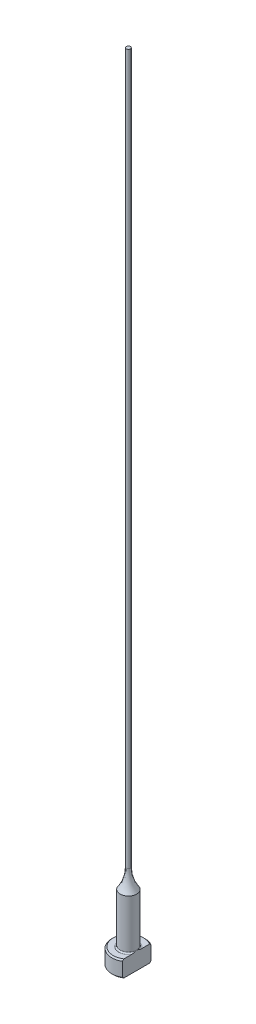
ISO-10303-21;
HEADER;
FILE_DESCRIPTION(('STEP AP214'),'2;1');
FILE_NAME('part.step','',(''),(''),'','','');
FILE_SCHEMA(('AUTOMOTIVE_DESIGN { 1 0 10303 214 1 1 1 1 }'));
ENDSEC;
DATA;
#1=APPLICATION_CONTEXT('core data for automotive mechanical design processes');
#2=APPLICATION_PROTOCOL_DEFINITION('international standard','automotive_design',2000,#1);
#3=PRODUCT_CONTEXT('',#1,'mechanical');
#4=PRODUCT('Part','Part','',(#3));
#5=PRODUCT_RELATED_PRODUCT_CATEGORY('part','',(#4));
#6=PRODUCT_DEFINITION_FORMATION('','',#4);
#7=PRODUCT_DEFINITION_CONTEXT('part definition',#1,'design');
#8=PRODUCT_DEFINITION('design','',#6,#7);
#9=PRODUCT_DEFINITION_SHAPE('','',#8);
#10=(LENGTH_UNIT() NAMED_UNIT(*) SI_UNIT(.MILLI.,.METRE.));
#11=(NAMED_UNIT(*) PLANE_ANGLE_UNIT() SI_UNIT($,.RADIAN.));
#12=(NAMED_UNIT(*) SI_UNIT($,.STERADIAN.) SOLID_ANGLE_UNIT());
#13=UNCERTAINTY_MEASURE_WITH_UNIT(LENGTH_MEASURE(1.E-05),#10,'distance_accuracy_value','');
#14=(GEOMETRIC_REPRESENTATION_CONTEXT(3) GLOBAL_UNCERTAINTY_ASSIGNED_CONTEXT((#13)) GLOBAL_UNIT_ASSIGNED_CONTEXT((#10,
#11,#12)) REPRESENTATION_CONTEXT('',''));
#15=CARTESIAN_POINT('',(0.,0.,0.));
#16=DIRECTION('',(0.,0.,1.));
#17=DIRECTION('',(1.,0.,0.));
#18=AXIS2_PLACEMENT_3D('',#15,#16,#17);
#19=CARTESIAN_POINT('',(-3.17499999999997,3.175,0.));
#20=DIRECTION('',(0.,1.,0.));
#21=DIRECTION('',(0.,0.,1.));
#22=AXIS2_PLACEMENT_3D('',#19,#20,#21);
#23=PLANE('',#22);
#24=CARTESIAN_POINT('',(0.,3.175,0.));
#25=DIRECTION('',(0.,1.,0.));
#26=DIRECTION('',(0.,0.,1.));
#27=AXIS2_PLACEMENT_3D('',#24,#25,#26);
#28=CIRCLE('',#27,2.92099999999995);
#29=CARTESIAN_POINT('',(1.58749999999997,3.175,-2.45195529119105));
#30=VERTEX_POINT('',#29);
#31=CARTESIAN_POINT('',(1.58749999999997,3.175,2.45195529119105));
#32=VERTEX_POINT('',#31);
#33=EDGE_CURVE('E105',#30,#32,#28,.T.);
#34=ORIENTED_EDGE('',*,*,#33,.T.);
#35=DIRECTION('',(0.,0.,1.));
#36=VECTOR('',#35,1.);
#37=CARTESIAN_POINT('',(1.58749999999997,3.17500000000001,2.74963065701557));
#38=LINE('',#37,#36);
#39=CARTESIAN_POINT('',(1.58749999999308,3.175,0.933255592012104));
#40=VERTEX_POINT('',#39);
#41=EDGE_CURVE('E126',#40,#32,#38,.T.);
#42=ORIENTED_EDGE('',*,*,#41,.F.);
#43=CARTESIAN_POINT('',(0.,3.175,0.));
#44=DIRECTION('',(0.,1.,0.));
#45=DIRECTION('',(0.,0.,1.));
#46=AXIS2_PLACEMENT_3D('',#43,#44,#45);
#47=CIRCLE('',#46,1.84149999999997);
#48=CARTESIAN_POINT('',(1.58749999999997,3.17500000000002,-0.933255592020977));
#49=VERTEX_POINT('',#48);
#50=EDGE_CURVE('E11',#40,#49,#47,.F.);
#51=ORIENTED_EDGE('',*,*,#50,.T.);
#52=EDGE_CURVE('E52',#30,#49,#38,.T.);
#53=ORIENTED_EDGE('',*,*,#52,.F.);
#54=EDGE_LOOP('',(#34,#42,#51,#53));
#55=FACE_BOUND('',#54,.T.);
#56=ADVANCED_FACE('F32',(#55),#23,.T.);
#57=CARTESIAN_POINT('',(0.,259.958771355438,0.));
#58=DIRECTION('',(0.,1.,0.));
#59=DIRECTION('',(0.,0.,1.));
#60=AXIS2_PLACEMENT_3D('',#57,#58,#59);
#61=CYLINDRICAL_SURFACE('',#60,3.17499999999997);
#62=CARTESIAN_POINT('',(0.,2.92100000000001,0.));
#63=DIRECTION('',(0.,1.,0.));
#64=DIRECTION('',(0.,0.,1.));
#65=AXIS2_PLACEMENT_3D('',#62,#63,#64);
#66=CIRCLE('',#65,3.17499999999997);
#67=CARTESIAN_POINT('',(1.58749999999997,2.92100000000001,2.74963065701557));
#68=VERTEX_POINT('',#67);
#69=CARTESIAN_POINT('',(1.58749999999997,2.92100000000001,-2.74963065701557));
#70=VERTEX_POINT('',#69);
#71=EDGE_CURVE('E98',#68,#70,#66,.F.);
#72=ORIENTED_EDGE('',*,*,#71,.T.);
#73=DIRECTION('',(0.,-1.,0.));
#74=VECTOR('',#73,1.);
#75=CARTESIAN_POINT('',(1.58749999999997,152.401,-2.74963065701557));
#76=LINE('',#75,#74);
#77=CARTESIAN_POINT('',(1.58749999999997,0.254000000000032,-2.74963065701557));
#78=VERTEX_POINT('',#77);
#79=EDGE_CURVE('E141',#70,#78,#76,.T.);
#80=ORIENTED_EDGE('',*,*,#79,.T.);
#81=CARTESIAN_POINT('',(0.,0.254000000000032,0.));
#82=DIRECTION('',(0.,-1.,0.));
#83=DIRECTION('',(0.,0.,-1.));
#84=AXIS2_PLACEMENT_3D('',#81,#82,#83);
#85=CIRCLE('',#84,3.17499999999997);
#86=CARTESIAN_POINT('',(1.58749999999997,0.254000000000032,2.74963065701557));
#87=VERTEX_POINT('',#86);
#88=EDGE_CURVE('E95',#78,#87,#85,.F.);
#89=ORIENTED_EDGE('',*,*,#88,.T.);
#90=DIRECTION('',(0.,-1.,0.));
#91=VECTOR('',#90,1.);
#92=CARTESIAN_POINT('',(1.58749999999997,152.401,2.74963065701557));
#93=LINE('',#92,#91);
#94=EDGE_CURVE('E88',#68,#87,#93,.T.);
#95=ORIENTED_EDGE('',*,*,#94,.F.);
#96=EDGE_LOOP('',(#72,#80,#89,#95));
#97=FACE_BOUND('',#96,.T.);
#98=ADVANCED_FACE('F191',(#97),#61,.T.);
#99=CARTESIAN_POINT('',(0.,0.,0.));
#100=DIRECTION('',(0.,-1.,0.));
#101=DIRECTION('',(0.,0.,-1.));
#102=AXIS2_PLACEMENT_3D('',#99,#100,#101);
#103=PLANE('',#102);
#104=CARTESIAN_POINT('',(0.,0.,0.));
#105=DIRECTION('',(0.,-1.,0.));
#106=DIRECTION('',(0.,0.,-1.));
#107=AXIS2_PLACEMENT_3D('',#104,#105,#106);
#108=CIRCLE('',#107,2.92099999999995);
#109=CARTESIAN_POINT('',(1.58749999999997,0.,2.45195529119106));
#110=VERTEX_POINT('',#109);
#111=CARTESIAN_POINT('',(1.58749999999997,0.,-2.45195529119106));
#112=VERTEX_POINT('',#111);
#113=EDGE_CURVE('E93',#110,#112,#108,.T.);
#114=ORIENTED_EDGE('',*,*,#113,.T.);
#115=DIRECTION('',(0.,0.,1.));
#116=VECTOR('',#115,1.);
#117=CARTESIAN_POINT('',(1.58749999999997,0.,2.74963065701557));
#118=LINE('',#117,#116);
#119=EDGE_CURVE('E78',#112,#110,#118,.T.);
#120=ORIENTED_EDGE('',*,*,#119,.T.);
#121=EDGE_LOOP('',(#114,#120));
#122=FACE_BOUND('',#121,.T.);
#123=ADVANCED_FACE('F97',(#122),#103,.T.);
#124=CARTESIAN_POINT('',(0.,3.17499999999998,0.));
#125=DIRECTION('',(0.,-1.,0.));
#126=DIRECTION('',(0.,0.,-1.));
#127=AXIS2_PLACEMENT_3D('',#124,#125,#126);
#128=CONICAL_SURFACE('',#127,2.92099999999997,0.7853981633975);
#129=ORIENTED_EDGE('',*,*,#71,.F.);
#130=CARTESIAN_POINT('',(1.58749999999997,-0.161620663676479,-6.0529050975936));
#131=CARTESIAN_POINT('',(1.58749999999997,-0.0288893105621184,-5.91567682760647));
#132=CARTESIAN_POINT('',(1.58749999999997,0.103699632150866,-5.77831035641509));
#133=CARTESIAN_POINT('',(1.58749999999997,0.36850839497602,-5.5032187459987));
#134=CARTESIAN_POINT('',(1.58749999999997,0.500728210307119,-5.36549360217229));
#135=CARTESIAN_POINT('',(1.58749999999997,0.764778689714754,-5.08953516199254));
#136=CARTESIAN_POINT('',(1.58749999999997,0.896609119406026,-4.95130164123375));
#137=CARTESIAN_POINT('',(1.58749999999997,1.15968706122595,-4.67428233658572));
#138=CARTESIAN_POINT('',(1.58749999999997,1.29093457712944,-4.53549655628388));
#139=CARTESIAN_POINT('',(1.58749999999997,1.55007705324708,-4.25997724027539));
#140=CARTESIAN_POINT('',(1.58749999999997,1.67798684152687,-4.12325766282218));
#141=CARTESIAN_POINT('',(1.58749999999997,1.93284861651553,-3.84892898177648));
#142=CARTESIAN_POINT('',(1.58749999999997,2.05980060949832,-3.71131988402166));
#143=CARTESIAN_POINT('',(1.58749999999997,2.31237508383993,-3.43493978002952));
#144=CARTESIAN_POINT('',(1.58749999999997,2.43799784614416,-3.29616903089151));
#145=CARTESIAN_POINT('',(1.58749999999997,2.68741369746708,-3.01699558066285));
#146=CARTESIAN_POINT('',(1.58749999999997,2.81120686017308,-2.87659294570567));
#147=CARTESIAN_POINT('',(1.58749999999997,3.0087586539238,-2.6481670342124));
#148=CARTESIAN_POINT('',(1.58749999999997,3.08336151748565,-2.56087478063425));
#149=CARTESIAN_POINT('',(1.58749999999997,3.23123871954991,-2.38515423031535));
#150=CARTESIAN_POINT('',(1.58749999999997,3.30451292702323,-2.29672582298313));
#151=CARTESIAN_POINT('',(1.58749999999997,3.45004422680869,-2.1174740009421));
#152=CARTESIAN_POINT('',(1.58749999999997,3.52228237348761,-2.02663514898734));
#153=CARTESIAN_POINT('',(1.58749999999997,3.6642309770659,-1.8430252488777));
#154=CARTESIAN_POINT('',(1.58749999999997,3.73394203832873,-1.75025467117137));
#155=CARTESIAN_POINT('',(1.58749999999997,3.87080633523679,-1.56067475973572));
#156=CARTESIAN_POINT('',(1.58749999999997,3.93790459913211,-1.46382547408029));
#157=CARTESIAN_POINT('',(1.58749999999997,4.06669147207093,-1.26632594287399));
#158=CARTESIAN_POINT('',(1.58749999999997,4.12837264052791,-1.16567073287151));
#159=CARTESIAN_POINT('',(1.58749999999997,4.2140225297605,-1.01165766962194));
#160=CARTESIAN_POINT('',(1.58749999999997,4.24127929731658,-0.960142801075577));
#161=CARTESIAN_POINT('',(1.58749999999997,4.29309798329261,-0.855780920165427));
#162=CARTESIAN_POINT('',(1.58749999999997,4.31765941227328,-0.802933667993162));
#163=CARTESIAN_POINT('',(1.58749999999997,4.38614656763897,-0.64246114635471));
#164=CARTESIAN_POINT('',(1.58749999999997,4.42510149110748,-0.532518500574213));
#165=CARTESIAN_POINT('',(1.58749999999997,4.46726244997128,-0.367680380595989));
#166=CARTESIAN_POINT('',(1.58749999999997,4.47844427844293,-0.314802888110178));
#167=CARTESIAN_POINT('',(1.58749999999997,4.495766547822,-0.2082097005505));
#168=CARTESIAN_POINT('',(1.58749999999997,4.50190743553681,-0.154494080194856));
#169=CARTESIAN_POINT('',(1.58749999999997,4.50871296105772,-0.0468792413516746));
#170=CARTESIAN_POINT('',(1.58749999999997,4.50939451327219,0.0070188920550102));
#171=CARTESIAN_POINT('',(1.58749999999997,4.50527679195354,0.114606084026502));
#172=CARTESIAN_POINT('',(1.58749999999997,4.50047706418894,0.168295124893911));
#173=CARTESIAN_POINT('',(1.58749999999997,4.48579689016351,0.274485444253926));
#174=CARTESIAN_POINT('',(1.58749999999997,4.47596081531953,0.326992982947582));
#175=CARTESIAN_POINT('',(1.58749999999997,4.45181809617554,0.430974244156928));
#176=CARTESIAN_POINT('',(1.58749999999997,4.43750969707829,0.48244755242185));
#177=CARTESIAN_POINT('',(1.58749999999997,4.40502489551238,0.584460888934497));
#178=CARTESIAN_POINT('',(1.58749999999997,4.38682724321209,0.634994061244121));
#179=CARTESIAN_POINT('',(1.58749999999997,4.34729308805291,0.734789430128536));
#180=CARTESIAN_POINT('',(1.58749999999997,4.32595722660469,0.784051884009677));
#181=CARTESIAN_POINT('',(1.58749999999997,4.25791922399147,0.930549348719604));
#182=CARTESIAN_POINT('',(1.58749999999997,4.20736047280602,1.02598802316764));
#183=CARTESIAN_POINT('',(1.58749999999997,4.09955451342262,1.2130431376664));
#184=CARTESIAN_POINT('',(1.58749999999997,4.04229912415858,1.30465471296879));
#185=CARTESIAN_POINT('',(1.58749999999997,3.9230874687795,1.4852621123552));
#186=CARTESIAN_POINT('',(1.58749999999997,3.86111349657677,1.57424615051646));
#187=CARTESIAN_POINT('',(1.58749999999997,3.73408621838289,1.74990003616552));
#188=CARTESIAN_POINT('',(1.58749999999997,3.66903444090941,1.8365709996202));
#189=CARTESIAN_POINT('',(1.58749999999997,3.53583371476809,2.00931764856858));
#190=CARTESIAN_POINT('',(1.58749999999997,3.46765527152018,2.09537048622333));
#191=CARTESIAN_POINT('',(1.58749999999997,3.32960643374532,2.26611736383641));
#192=CARTESIAN_POINT('',(1.58749999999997,3.25973586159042,2.35081125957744));
#193=CARTESIAN_POINT('',(1.58749999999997,3.04858139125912,2.60290121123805));
#194=CARTESIAN_POINT('',(1.58749999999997,2.90542388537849,2.76872537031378));
#195=CARTESIAN_POINT('',(1.58749999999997,2.64069522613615,3.06970913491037));
#196=CARTESIAN_POINT('',(1.58749999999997,2.5195945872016,3.20528660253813));
#197=CARTESIAN_POINT('',(1.58749999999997,2.275904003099,3.47510321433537));
#198=CARTESIAN_POINT('',(1.58749999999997,2.15331401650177,3.60934232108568));
#199=CARTESIAN_POINT('',(1.58749999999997,1.90694239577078,3.87695374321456));
#200=CARTESIAN_POINT('',(1.58749999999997,1.78315974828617,4.01032512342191));
#201=CARTESIAN_POINT('',(1.58749999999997,1.53478104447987,4.2763088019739));
#202=CARTESIAN_POINT('',(1.58749999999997,1.41018498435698,4.40892109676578));
#203=CARTESIAN_POINT('',(1.58749999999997,1.0457468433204,4.79499418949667));
#204=CARTESIAN_POINT('',(1.58749999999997,0.805076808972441,5.04767313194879));
#205=CARTESIAN_POINT('',(1.58749999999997,0.443121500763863,5.42550911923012));
#206=CARTESIAN_POINT('',(1.58749999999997,0.322378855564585,5.55118772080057));
#207=CARTESIAN_POINT('',(1.58749999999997,0.0805914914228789,5.80225207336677));
#208=CARTESIAN_POINT('',(1.58749999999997,-0.0404532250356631,5.92763782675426));
#209=CARTESIAN_POINT('',(1.58749999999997,-0.161620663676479,6.0529050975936));
#210=B_SPLINE_CURVE_WITH_KNOTS('',3,(#130,#131,#132,#133,#134,#135,#136,#137,#138,#139,#140,
#141,#142,#143,#144,#145,#146,#147,#148,#149,#150,#151,#152,#153,#154,#155,#156,#157,#158,#159,
#160,#161,#162,#163,#164,#165,#166,#167,#168,#169,#170,#171,#172,#173,#174,#175,#176,#177,#178,
#179,#180,#181,#182,#183,#184,#185,#186,#187,#188,#189,#190,#191,#192,#193,#194,#195,#196,#197,
#198,#199,#200,#201,#202,#203,#204,#205,#206,#207,#208,#209),.UNSPECIFIED.,.F.,.F.,(4,2,2,2,2,2,
2,2,2,2,2,2,2,2,2,2,2,2,2,2,2,2,2,2,2,2,2,2,2,2,2,2,2,2,2,2,2,2,2,4),(0.,0.572750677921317,
1.14550874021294,1.71856057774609,2.29160869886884,2.85328006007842,3.41494773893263,
3.97649423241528,4.53801804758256,4.88249307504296,5.22700189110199,5.57515326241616,
5.92322081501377,6.27657800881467,6.63041319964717,6.80518126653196,6.97998101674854,
7.32824262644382,7.49018491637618,7.65211285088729,7.813538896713,7.97497832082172,
8.13501929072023,8.29512313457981,8.4561251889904,8.61709438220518,8.94062993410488,
9.26456495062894,9.58978187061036,9.91483894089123,10.2441741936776,10.5735441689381,
11.2306812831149,11.7760337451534,12.3214014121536,12.8672825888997,13.4131663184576,
14.4600164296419,14.9828595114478,15.505698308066),.UNSPECIFIED.);
#211=EDGE_CURVE('E118',#32,#68,#210,.T.);
#212=ORIENTED_EDGE('',*,*,#211,.F.);
#213=ORIENTED_EDGE('',*,*,#33,.F.);
#214=EDGE_CURVE('E117',#70,#30,#210,.T.);
#215=ORIENTED_EDGE('',*,*,#214,.F.);
#216=EDGE_LOOP('',(#129,#212,#213,#215));
#217=FACE_BOUND('',#216,.T.);
#218=ADVANCED_FACE('F162',(#217),#128,.T.);
#219=CARTESIAN_POINT('',(0.,0.254000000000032,0.));
#220=DIRECTION('',(0.,1.,0.));
#221=DIRECTION('',(0.,0.,1.));
#222=AXIS2_PLACEMENT_3D('',#219,#220,#221);
#223=CONICAL_SURFACE('',#222,3.17499999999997,0.785398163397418);
#224=ORIENTED_EDGE('',*,*,#88,.F.);
#225=CARTESIAN_POINT('',(1.58749999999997,3.33662066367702,6.0529050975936));
#226=CARTESIAN_POINT('',(1.58749999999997,3.20388931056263,5.91567682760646));
#227=CARTESIAN_POINT('',(1.58749999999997,3.0713003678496,5.77831035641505));
#228=CARTESIAN_POINT('',(1.58749999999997,2.80649160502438,5.50321874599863));
#229=CARTESIAN_POINT('',(1.58749999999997,2.67427178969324,5.36549360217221));
#230=CARTESIAN_POINT('',(1.58749999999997,2.41022131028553,5.08953516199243));
#231=CARTESIAN_POINT('',(1.58749999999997,2.27839088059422,4.95130164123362));
#232=CARTESIAN_POINT('',(1.58749999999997,2.01531293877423,4.67428233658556));
#233=CARTESIAN_POINT('',(1.58749999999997,1.8840654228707,4.5354965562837));
#234=CARTESIAN_POINT('',(1.58749999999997,1.62492294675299,4.25997724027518));
#235=CARTESIAN_POINT('',(1.58749999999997,1.49701315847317,4.12325766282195));
#236=CARTESIAN_POINT('',(1.58749999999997,1.24215138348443,3.84892898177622));
#237=CARTESIAN_POINT('',(1.58749999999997,1.11519939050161,3.71131988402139));
#238=CARTESIAN_POINT('',(1.58749999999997,0.862624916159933,3.43493978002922));
#239=CARTESIAN_POINT('',(1.58749999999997,0.737002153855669,3.29616903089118));
#240=CARTESIAN_POINT('',(1.58749999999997,0.487586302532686,3.01699558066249));
#241=CARTESIAN_POINT('',(1.58749999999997,0.363793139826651,2.8765929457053));
#242=CARTESIAN_POINT('',(1.58749999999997,0.1662413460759,2.64816703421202));
#243=CARTESIAN_POINT('',(1.58749999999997,0.0916384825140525,2.56087478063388));
#244=CARTESIAN_POINT('',(1.58749999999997,-0.0562387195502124,2.385154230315));
#245=CARTESIAN_POINT('',(1.58749999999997,-0.129512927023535,2.29672582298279));
#246=CARTESIAN_POINT('',(1.58749999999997,-0.275044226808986,2.11747400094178));
#247=CARTESIAN_POINT('',(1.58749999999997,-0.34728237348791,2.02663514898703));
#248=CARTESIAN_POINT('',(1.58749999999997,-0.489230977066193,1.84302524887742));
#249=CARTESIAN_POINT('',(1.58749999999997,-0.558942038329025,1.75025467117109));
#250=CARTESIAN_POINT('',(1.58749999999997,-0.695806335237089,1.56067475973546));
#251=CARTESIAN_POINT('',(1.58749999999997,-0.762904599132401,1.46382547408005));
#252=CARTESIAN_POINT('',(1.58749999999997,-0.89169147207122,1.26632594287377));
#253=CARTESIAN_POINT('',(1.58749999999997,-0.953372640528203,1.16567073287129));
#254=CARTESIAN_POINT('',(1.58749999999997,-1.03902252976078,1.01165766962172));
#255=CARTESIAN_POINT('',(1.58749999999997,-1.06627929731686,0.960142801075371));
#256=CARTESIAN_POINT('',(1.58749999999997,-1.11809798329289,0.855780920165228));
#257=CARTESIAN_POINT('',(1.58749999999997,-1.14265941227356,0.802933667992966));
#258=CARTESIAN_POINT('',(1.58749999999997,-1.21114656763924,0.642461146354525));
#259=CARTESIAN_POINT('',(1.58749999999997,-1.25010149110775,0.532518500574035));
#260=CARTESIAN_POINT('',(1.58749999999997,-1.29226244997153,0.36768038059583));
#261=CARTESIAN_POINT('',(1.58749999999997,-1.30344427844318,0.31480288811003));
#262=CARTESIAN_POINT('',(1.58749999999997,-1.32076654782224,0.208209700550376));
#263=CARTESIAN_POINT('',(1.58749999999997,-1.32690743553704,0.154494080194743));
#264=CARTESIAN_POINT('',(1.58749999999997,-1.33371296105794,0.0468792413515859));
#265=CARTESIAN_POINT('',(1.58749999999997,-1.33439451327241,-0.0070188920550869));
#266=CARTESIAN_POINT('',(1.58749999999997,-1.33027679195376,-0.114606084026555));
#267=CARTESIAN_POINT('',(1.58749999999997,-1.32547706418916,-0.168295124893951));
#268=CARTESIAN_POINT('',(1.58749999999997,-1.31079689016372,-0.274485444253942));
#269=CARTESIAN_POINT('',(1.58749999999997,-1.30096081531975,-0.326992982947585));
#270=CARTESIAN_POINT('',(1.58749999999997,-1.27681809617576,-0.430974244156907));
#271=CARTESIAN_POINT('',(1.58749999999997,-1.26250969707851,-0.482447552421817));
#272=CARTESIAN_POINT('',(1.58749999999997,-1.2300248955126,-0.584460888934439));
#273=CARTESIAN_POINT('',(1.58749999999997,-1.21182724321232,-0.634994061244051));
#274=CARTESIAN_POINT('',(1.58749999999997,-1.17229308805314,-0.734789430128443));
#275=CARTESIAN_POINT('',(1.58749999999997,-1.15095722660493,-0.784051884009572));
#276=CARTESIAN_POINT('',(1.58749999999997,-1.08291922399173,-0.93054934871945));
#277=CARTESIAN_POINT('',(1.58749999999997,-1.0323604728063,-1.02598802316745));
#278=CARTESIAN_POINT('',(1.58749999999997,-0.92455451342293,-1.21304313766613));
#279=CARTESIAN_POINT('',(1.58749999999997,-0.867299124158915,-1.30465471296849));
#280=CARTESIAN_POINT('',(1.58749999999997,-0.748087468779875,-1.48526211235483));
#281=CARTESIAN_POINT('',(1.58749999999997,-0.686113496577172,-1.57424615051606));
#282=CARTESIAN_POINT('',(1.58749999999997,-0.559086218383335,-1.74990003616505));
#283=CARTESIAN_POINT('',(1.58749999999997,-0.494034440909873,-1.83657099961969));
#284=CARTESIAN_POINT('',(1.58749999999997,-0.360833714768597,-2.00931764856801));
#285=CARTESIAN_POINT('',(1.58749999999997,-0.292655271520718,-2.09537048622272));
#286=CARTESIAN_POINT('',(1.58749999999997,-0.154606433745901,-2.26611736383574));
#287=CARTESIAN_POINT('',(1.58749999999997,-0.084735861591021,-2.35081125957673));
#288=CARTESIAN_POINT('',(1.58749999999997,0.126418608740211,-2.60290121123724));
#289=CARTESIAN_POINT('',(1.58749999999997,0.26957611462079,-2.76872537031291));
#290=CARTESIAN_POINT('',(1.58749999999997,0.534304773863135,-3.06970913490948));
#291=CARTESIAN_POINT('',(1.58749999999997,0.655405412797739,-3.20528660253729));
#292=CARTESIAN_POINT('',(1.58749999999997,0.899095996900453,-3.47510321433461));
#293=CARTESIAN_POINT('',(1.58749999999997,1.02168598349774,-3.60934232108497));
#294=CARTESIAN_POINT('',(1.58749999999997,1.26805760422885,-3.87695374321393));
#295=CARTESIAN_POINT('',(1.58749999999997,1.39184025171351,-4.01032512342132));
#296=CARTESIAN_POINT('',(1.58749999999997,1.64021895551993,-4.2763088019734));
#297=CARTESIAN_POINT('',(1.58749999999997,1.76481501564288,-4.40892109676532));
#298=CARTESIAN_POINT('',(1.58749999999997,2.12925315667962,-4.79499418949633));
#299=CARTESIAN_POINT('',(1.58749999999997,2.36992319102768,-5.04767313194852));
#300=CARTESIAN_POINT('',(1.58749999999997,2.73187849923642,-5.42550911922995));
#301=CARTESIAN_POINT('',(1.58749999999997,2.85262114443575,-5.55118772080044));
#302=CARTESIAN_POINT('',(1.58749999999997,3.09440850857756,-5.8022520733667));
#303=CARTESIAN_POINT('',(1.58749999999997,3.21545322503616,-5.92763782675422));
#304=CARTESIAN_POINT('',(1.58749999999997,3.33662066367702,-6.0529050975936));
#305=B_SPLINE_CURVE_WITH_KNOTS('',3,(#225,#226,#227,#228,#229,#230,#231,#232,#233,#234,#235,
#236,#237,#238,#239,#240,#241,#242,#243,#244,#245,#246,#247,#248,#249,#250,#251,#252,#253,#254,
#255,#256,#257,#258,#259,#260,#261,#262,#263,#264,#265,#266,#267,#268,#269,#270,#271,#272,#273,
#274,#275,#276,#277,#278,#279,#280,#281,#282,#283,#284,#285,#286,#287,#288,#289,#290,#291,#292,
#293,#294,#295,#296,#297,#298,#299,#300,#301,#302,#303,#304),.UNSPECIFIED.,.F.,.F.,(4,2,2,2,2,2,
2,2,2,2,2,2,2,2,2,2,2,2,2,2,2,2,2,2,2,2,2,2,2,2,2,2,2,2,2,2,2,2,2,4),(0.,0.572750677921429,
1.14550874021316,1.71856057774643,2.29160869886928,2.85328006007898,3.41494773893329,
3.97649423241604,4.53801804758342,4.8824930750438,5.22700189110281,5.57515326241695,
5.92322081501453,6.27657800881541,6.63041319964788,6.80518126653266,6.97998101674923,
7.32824262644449,7.49018491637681,7.65211285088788,7.81353889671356,7.97497832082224,
8.13501929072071,8.29512313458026,8.45612518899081,8.61709438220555,8.94062993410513,
9.26456495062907,9.58978187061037,9.91483894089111,10.2441741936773,10.5735441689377,
11.2306812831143,11.776033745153,12.3214014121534,12.8672825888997,13.4131663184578,
14.4600164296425,14.9828595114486,15.505698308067),.UNSPECIFIED.);
#306=EDGE_CURVE('E81',#112,#78,#305,.T.);
#307=ORIENTED_EDGE('',*,*,#306,.F.);
#308=ORIENTED_EDGE('',*,*,#113,.F.);
#309=EDGE_CURVE('E84',#87,#110,#305,.T.);
#310=ORIENTED_EDGE('',*,*,#309,.F.);
#311=EDGE_LOOP('',(#224,#307,#308,#310));
#312=FACE_BOUND('',#311,.T.);
#313=ADVANCED_FACE('F92',(#312),#223,.T.);
#314=CARTESIAN_POINT('',(0.,3.42900000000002,0.));
#315=DIRECTION('',(0.,1.,0.));
#316=DIRECTION('',(0.,0.,1.));
#317=AXIS2_PLACEMENT_3D('',#314,#315,#316);
#318=TOROIDAL_SURFACE('',#317,1.84149999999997,0.254);
#319=CARTESIAN_POINT('',(1.58749999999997,3.42900000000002,0.));
#320=CARTESIAN_POINT('',(1.58749999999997,3.42899942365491,-1.9220514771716E-10));
#321=CARTESIAN_POINT('',(1.58749999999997,3.42899884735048,-1.2261161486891E-07));
#322=CARTESIAN_POINT('',(1.58749999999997,3.42899773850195,-5.09676365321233E-07));
#323=CARTESIAN_POINT('',(1.58749999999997,3.42899720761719,-7.78176328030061E-07));
#324=CARTESIAN_POINT('',(1.58749999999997,3.42899614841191,-1.42307272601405E-06));
#325=CARTESIAN_POINT('',(1.58749999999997,3.42899562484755,-1.80713867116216E-06));
#326=CARTESIAN_POINT('',(1.58749999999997,3.42899463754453,-2.63494846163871E-06));
#327=CARTESIAN_POINT('',(1.58749999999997,3.42899417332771,-3.07814756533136E-06));
#328=CARTESIAN_POINT('',(1.58749999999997,3.42899261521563,-4.66897357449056E-06));
#329=CARTESIAN_POINT('',(1.58749999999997,3.42899159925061,-5.89404908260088E-06));
#330=CARTESIAN_POINT('',(1.58749999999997,3.42898979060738,-8.42427511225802E-06));
#331=CARTESIAN_POINT('',(1.58749999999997,3.42898899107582,-9.7248057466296E-06));
#332=CARTESIAN_POINT('',(1.58749999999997,3.42898598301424,-1.48060601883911E-05));
#333=CARTESIAN_POINT('',(1.58749999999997,3.42898393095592,-1.86838281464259E-05));
#334=CARTESIAN_POINT('',(1.58749999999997,3.42898057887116,-2.63261117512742E-05));
#335=CARTESIAN_POINT('',(1.58749999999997,3.42897922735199,-3.00687417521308E-05));
#336=CARTESIAN_POINT('',(1.58749999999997,3.42897347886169,-4.60276298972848E-05));
#337=CARTESIAN_POINT('',(1.58749999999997,3.42896911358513,-5.8247019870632E-05));
#338=CARTESIAN_POINT('',(1.58749999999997,3.42896211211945,-8.11070097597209E-05));
#339=CARTESIAN_POINT('',(1.58749999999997,3.42895931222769,-9.16953114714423E-05));
#340=CARTESIAN_POINT('',(1.58749999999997,3.42893712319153,-0.000168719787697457));
#341=CARTESIAN_POINT('',(1.58749999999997,3.42890881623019,-0.000232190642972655));
#342=CARTESIAN_POINT('',(1.58749999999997,3.42880276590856,-0.000479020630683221));
#343=CARTESIAN_POINT('',(1.58749999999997,3.42873165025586,-0.00066443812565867));
#344=CARTESIAN_POINT('',(1.58749999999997,3.42845137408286,-0.0013844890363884));
#345=CARTESIAN_POINT('',(1.58749999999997,3.42823526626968,-0.00191701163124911));
#346=CARTESIAN_POINT('',(1.58749999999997,3.42735449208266,-0.00409774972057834));
#347=CARTESIAN_POINT('',(1.58749999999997,3.42669768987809,-0.00574830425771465));
#348=CARTESIAN_POINT('',(1.58749999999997,3.4174405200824,-0.0289985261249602));
#349=CARTESIAN_POINT('',(1.58749999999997,3.40878325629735,-0.0505816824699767));
#350=CARTESIAN_POINT('',(1.58749999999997,3.39189297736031,-0.0929947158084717));
#351=CARTESIAN_POINT('',(1.58749999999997,3.38365605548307,-0.11382315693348));
#352=CARTESIAN_POINT('',(1.58749999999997,3.36635393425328,-0.157956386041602));
#353=CARTESIAN_POINT('',(1.58749999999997,3.35730391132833,-0.181267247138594));
#354=CARTESIAN_POINT('',(1.58749999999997,3.33936775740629,-0.228222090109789));
#355=CARTESIAN_POINT('',(1.58749999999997,3.33048420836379,-0.25186705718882));
#356=CARTESIAN_POINT('',(1.58749999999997,3.30894496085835,-0.310512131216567));
#357=CARTESIAN_POINT('',(1.58749999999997,3.29649449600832,-0.345588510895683));
#358=CARTESIAN_POINT('',(1.58749999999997,3.27296975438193,-0.415278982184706));
#359=CARTESIAN_POINT('',(1.58749999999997,3.26186987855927,-0.449884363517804));
#360=CARTESIAN_POINT('',(1.58749999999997,3.2395832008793,-0.524471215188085));
#361=CARTESIAN_POINT('',(1.58749999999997,3.22860862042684,-0.564517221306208));
#362=CARTESIAN_POINT('',(1.58749999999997,3.20902534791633,-0.645529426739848));
#363=CARTESIAN_POINT('',(1.58749999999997,3.20043582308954,-0.686500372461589));
#364=CARTESIAN_POINT('',(1.58749999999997,3.18611712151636,-0.771546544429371));
#365=CARTESIAN_POINT('',(1.58749999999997,3.18059550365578,-0.815658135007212));
#366=CARTESIAN_POINT('',(1.58749999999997,3.17455396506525,-0.904117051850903));
#367=CARTESIAN_POINT('',(1.58749999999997,3.17401361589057,-0.948462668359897));
#368=CARTESIAN_POINT('',(1.58749999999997,3.17898948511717,-1.02531896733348));
#369=CARTESIAN_POINT('',(1.58749999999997,3.1829739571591,-1.05792141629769));
#370=CARTESIAN_POINT('',(1.58749999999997,3.19569167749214,-1.12184393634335));
#371=CARTESIAN_POINT('',(1.58749999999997,3.20436049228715,-1.1531753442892));
#372=CARTESIAN_POINT('',(1.58749999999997,3.22236152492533,-1.19946468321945));
#373=CARTESIAN_POINT('',(1.58749999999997,3.2295150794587,-1.21526783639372));
#374=CARTESIAN_POINT('',(1.58749999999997,3.24587062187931,-1.24583726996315));
#375=CARTESIAN_POINT('',(1.58749999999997,3.25507530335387,-1.26060215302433));
#376=CARTESIAN_POINT('',(1.58749999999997,3.27378481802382,-1.28575815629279));
#377=CARTESIAN_POINT('',(1.58749999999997,3.28289001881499,-1.29644383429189));
#378=CARTESIAN_POINT('',(1.58749999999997,3.30268460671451,-1.31623154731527));
#379=CARTESIAN_POINT('',(1.58749999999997,3.31337067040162,-1.32533681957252));
#380=CARTESIAN_POINT('',(1.58749999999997,3.33349977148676,-1.33941140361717));
#381=CARTESIAN_POINT('',(1.58749999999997,3.34261446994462,-1.34484814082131));
#382=CARTESIAN_POINT('',(1.58749999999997,3.36161455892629,-1.35416329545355));
#383=CARTESIAN_POINT('',(1.58749999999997,3.37149946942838,-1.35804267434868));
#384=CARTESIAN_POINT('',(1.58749999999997,3.39188678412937,-1.36398436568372));
#385=CARTESIAN_POINT('',(1.58749999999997,3.40239309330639,-1.36603350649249));
#386=CARTESIAN_POINT('',(1.58749999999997,3.42360372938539,-1.3680840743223));
#387=CARTESIAN_POINT('',(1.58749999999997,3.43430795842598,-1.36808648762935));
#388=CARTESIAN_POINT('',(1.58749999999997,3.45433283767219,-1.36616208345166));
#389=CARTESIAN_POINT('',(1.58749999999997,3.46367506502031,-1.36444960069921));
#390=CARTESIAN_POINT('',(1.58749999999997,3.48195519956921,-1.35953338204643));
#391=CARTESIAN_POINT('',(1.58749999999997,3.49089304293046,-1.3563294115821));
#392=CARTESIAN_POINT('',(1.58749999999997,3.50850302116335,-1.34848006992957));
#393=CARTESIAN_POINT('',(1.58749999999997,3.5171531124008,-1.34378578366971));
#394=CARTESIAN_POINT('',(1.58749999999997,3.53371257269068,-1.33324445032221));
#395=CARTESIAN_POINT('',(1.58749999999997,3.54162163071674,-1.32739692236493));
#396=CARTESIAN_POINT('',(1.58749999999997,3.56107121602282,-1.31107304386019));
#397=CARTESIAN_POINT('',(1.58749999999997,3.57202221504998,-1.29989286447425));
#398=CARTESIAN_POINT('',(1.58749999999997,3.59202509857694,-1.27593566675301));
#399=CARTESIAN_POINT('',(1.58749999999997,3.60107086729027,-1.26315370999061));
#400=CARTESIAN_POINT('',(1.58749999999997,3.62186023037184,-1.22930733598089));
#401=CARTESIAN_POINT('',(1.58749999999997,3.63240584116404,-1.20751096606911));
#402=CARTESIAN_POINT('',(1.58749999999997,3.65004643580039,-1.16266144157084));
#403=CARTESIAN_POINT('',(1.58749999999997,3.65714435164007,-1.13960937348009));
#404=CARTESIAN_POINT('',(1.58749999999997,3.67265428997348,-1.07603916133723));
#405=CARTESIAN_POINT('',(1.58749999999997,3.67834921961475,-1.03486686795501));
#406=CARTESIAN_POINT('',(1.58749999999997,3.68382880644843,-0.951558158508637));
#407=CARTESIAN_POINT('',(1.58749999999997,3.68350976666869,-0.909417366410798));
#408=CARTESIAN_POINT('',(1.58749999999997,3.67745397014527,-0.811383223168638));
#409=CARTESIAN_POINT('',(1.58749999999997,3.66993873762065,-0.755610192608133));
#410=CARTESIAN_POINT('',(1.58749999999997,3.64933373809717,-0.644937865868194));
#411=CARTESIAN_POINT('',(1.58749999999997,3.63621897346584,-0.59004364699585));
#412=CARTESIAN_POINT('',(1.58749999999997,3.60740922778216,-0.485757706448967));
#413=CARTESIAN_POINT('',(1.58749999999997,3.59201096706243,-0.436281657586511));
#414=CARTESIAN_POINT('',(1.58749999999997,3.55922497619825,-0.338551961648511));
#415=CARTESIAN_POINT('',(1.58749999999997,3.5418584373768,-0.290291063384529));
#416=CARTESIAN_POINT('',(1.58749999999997,3.51760237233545,-0.225557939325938));
#417=CARTESIAN_POINT('',(1.58749999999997,3.51126413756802,-0.208874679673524));
#418=CARTESIAN_POINT('',(1.58749999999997,3.49830042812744,-0.17512392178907));
#419=CARTESIAN_POINT('',(1.58749999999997,3.49167176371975,-0.158057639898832));
#420=CARTESIAN_POINT('',(1.58749999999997,3.47585523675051,-0.117638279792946));
#421=CARTESIAN_POINT('',(1.58749999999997,3.46662970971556,-0.0943002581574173));
#422=CARTESIAN_POINT('',(1.58749999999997,3.44889695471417,-0.0497824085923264));
#423=CARTESIAN_POINT('',(1.58749999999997,3.44040039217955,-0.028598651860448));
#424=CARTESIAN_POINT('',(1.58749999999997,3.43130364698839,-0.00575168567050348));
#425=CARTESIAN_POINT('',(1.58749999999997,3.43064818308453,-0.00410451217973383));
#426=CARTESIAN_POINT('',(1.58749999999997,3.42976776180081,-0.00192459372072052));
#427=CARTESIAN_POINT('',(1.58749999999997,3.42955062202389,-0.00138952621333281));
#428=CARTESIAN_POINT('',(1.58749999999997,3.42926908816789,-0.000666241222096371));
#429=CARTESIAN_POINT('',(1.58749999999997,3.42919771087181,-0.000480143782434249));
#430=CARTESIAN_POINT('',(1.58749999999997,3.42909131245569,-0.000232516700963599));
#431=CARTESIAN_POINT('',(1.58749999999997,3.42906294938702,-0.000168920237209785));
#432=CARTESIAN_POINT('',(1.58749999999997,3.42904072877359,-9.17527162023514E-05));
#433=CARTESIAN_POINT('',(1.58749999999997,3.42903792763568,-8.11550293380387E-05));
#434=CARTESIAN_POINT('',(1.58749999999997,3.42903091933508,-5.82743948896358E-05));
#435=CARTESIAN_POINT('',(1.58749999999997,3.42902654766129,-4.60440001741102E-05));
#436=CARTESIAN_POINT('',(1.58749999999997,3.42902079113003,-3.00727682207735E-05));
#437=CARTESIAN_POINT('',(1.58749999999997,3.42901943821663,-2.63286807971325E-05));
#438=CARTESIAN_POINT('',(1.58749999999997,3.42901608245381,-1.86836529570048E-05));
#439=CARTESIAN_POINT('',(1.58749999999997,3.4290140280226,-1.48046517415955E-05));
#440=CARTESIAN_POINT('',(1.58749999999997,3.42901101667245,-9.72223943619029E-06));
#441=CARTESIAN_POINT('',(1.58749999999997,3.42901021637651,-8.42159649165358E-06));
#442=CARTESIAN_POINT('',(1.58749999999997,3.42900840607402,-5.89129729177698E-06));
#443=CARTESIAN_POINT('',(1.58749999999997,3.42900738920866,-4.66626867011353E-06));
#444=CARTESIAN_POINT('',(1.58749999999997,3.42900582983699,-3.07568803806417E-06));
#445=CARTESIAN_POINT('',(1.58749999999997,3.42900536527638,-2.63259565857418E-06));
#446=CARTESIAN_POINT('',(1.58749999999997,3.4290043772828,-1.80506085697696E-06));
#447=CARTESIAN_POINT('',(1.58749999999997,3.42900385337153,-1.42116387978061E-06));
#448=CARTESIAN_POINT('',(1.58749999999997,3.42900279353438,-7.76675643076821E-07));
#449=CARTESIAN_POINT('',(1.58749999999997,3.42900226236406,-5.08406487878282E-07));
#450=CARTESIAN_POINT('',(1.58749999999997,3.42900115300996,-1.21901887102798E-07));
#451=CARTESIAN_POINT('',(1.58749999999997,3.42900057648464,1.92251677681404E-10));
#452=CARTESIAN_POINT('',(1.58749999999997,3.42900000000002,0.));
#453=B_SPLINE_CURVE_WITH_KNOTS('',3,(#319,#320,#321,#322,#323,#324,#325,#326,#327,#328,#329,
#330,#331,#332,#333,#334,#335,#336,#337,#338,#339,#340,#341,#342,#343,#344,#345,#346,#347,#348,
#349,#350,#351,#352,#353,#354,#355,#356,#357,#358,#359,#360,#361,#362,#363,#364,#365,#366,#367,
#368,#369,#370,#371,#372,#373,#374,#375,#376,#377,#378,#379,#380,#381,#382,#383,#384,#385,#386,
#387,#388,#389,#390,#391,#392,#393,#394,#395,#396,#397,#398,#399,#400,#401,#402,#403,#404,#405,
#406,#407,#408,#409,#410,#411,#412,#413,#414,#415,#416,#417,#418,#419,#420,#421,#422,#423,#424,
#425,#426,#427,#428,#429,#430,#431,#432,#433,#434,#435,#436,#437,#438,#439,#440,#441,#442,#443,
#444,#445,#446,#447,#448,#449,#450,#451,#452),.UNSPECIFIED.,.T.,.F.,(4,2,2,2,2,2,2,2,2,2,2,2,2,
2,2,2,2,2,2,2,2,2,2,2,2,2,2,2,2,2,2,2,2,2,2,2,2,2,2,2,2,2,2,2,2,2,2,2,2,2,2,2,2,2,2,2,2,2,2,2,2,
2,2,2,2,2,4),(0.,1.72815458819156E-06,3.50429255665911E-06,5.44431004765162E-06,
7.3675525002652E-06,1.2119089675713E-05,1.66953775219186E-05,2.98160400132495E-05,
4.17409564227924E-05,8.0660475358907E-05,0.000113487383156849,0.000321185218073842,
0.000917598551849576,0.00264089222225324,0.00797105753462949,0.0777276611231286,
0.144923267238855,0.219939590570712,0.295714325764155,0.407362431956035,0.516367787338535,
0.640878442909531,0.766362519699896,0.899536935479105,1.03216495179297,1.13045740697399,
1.22743103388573,1.27935899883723,1.33135556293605,1.37333248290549,1.41522237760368,
1.44693946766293,1.47863694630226,1.51056074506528,1.54246916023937,1.57083210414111,
1.59919951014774,1.62861579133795,1.65804436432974,1.70472658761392,1.75155645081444,
1.82378709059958,1.89595619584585,2.01995471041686,2.1460932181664,2.31447224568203,
2.48361094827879,2.6389891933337,2.79283011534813,2.84637031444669,2.9012946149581,
2.97658236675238,3.04504771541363,3.05036697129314,3.05209849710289,3.05269709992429,
3.05290520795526,3.05293806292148,3.05297701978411,3.05298895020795,3.05300207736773,
3.05300665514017,3.0530114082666,3.05301333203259,3.05301527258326,3.05301704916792,
3.05301877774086),.UNSPECIFIED.);
#454=CARTESIAN_POINT('',(1.58749999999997,3.42900000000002,0.));
#455=VERTEX_POINT('',#454);
#456=EDGE_CURVE('E47',#455,#49,#453,.T.);
#457=ORIENTED_EDGE('',*,*,#456,.T.);
#458=ORIENTED_EDGE('',*,*,#50,.F.);
#459=CARTESIAN_POINT('',(1.58749999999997,3.42900000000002,0.));
#460=CARTESIAN_POINT('',(1.58749999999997,3.42900057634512,1.9220512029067E-10));
#461=CARTESIAN_POINT('',(1.58749999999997,3.42900115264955,1.22611614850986E-07));
#462=CARTESIAN_POINT('',(1.58749999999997,3.42900226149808,5.09676365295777E-07));
#463=CARTESIAN_POINT('',(1.58749999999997,3.42900279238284,7.78176328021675E-07));
#464=CARTESIAN_POINT('',(1.58749999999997,3.42900385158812,1.42307272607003E-06));
#465=CARTESIAN_POINT('',(1.58749999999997,3.42900437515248,1.80713867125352E-06));
#466=CARTESIAN_POINT('',(1.58749999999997,3.4290053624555,2.63494846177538E-06));
#467=CARTESIAN_POINT('',(1.58749999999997,3.42900582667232,3.0781475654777E-06));
#468=CARTESIAN_POINT('',(1.58749999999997,3.4290073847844,4.66897357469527E-06));
#469=CARTESIAN_POINT('',(1.58749999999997,3.42900840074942,5.89404908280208E-06));
#470=CARTESIAN_POINT('',(1.58749999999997,3.42901020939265,8.42427511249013E-06));
#471=CARTESIAN_POINT('',(1.58749999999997,3.42901100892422,9.72480574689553E-06));
#472=CARTESIAN_POINT('',(1.58749999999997,3.42901401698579,1.48060601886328E-05));
#473=CARTESIAN_POINT('',(1.58749999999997,3.42901606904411,1.86838281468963E-05));
#474=CARTESIAN_POINT('',(1.58749999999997,3.42901942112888,2.63261117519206E-05));
#475=CARTESIAN_POINT('',(1.58749999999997,3.42902077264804,3.00687417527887E-05));
#476=CARTESIAN_POINT('',(1.58749999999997,3.42902652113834,4.60276298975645E-05));
#477=CARTESIAN_POINT('',(1.58749999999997,3.4290308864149,5.82470198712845E-05));
#478=CARTESIAN_POINT('',(1.58749999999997,3.42903788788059,8.11070097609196E-05));
#479=CARTESIAN_POINT('',(1.58749999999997,3.42904068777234,9.16953114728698E-05));
#480=CARTESIAN_POINT('',(1.58749999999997,3.4290628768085,0.000168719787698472));
#481=CARTESIAN_POINT('',(1.58749999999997,3.42909118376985,0.000232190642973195));
#482=CARTESIAN_POINT('',(1.58749999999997,3.42919723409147,0.000479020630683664));
#483=CARTESIAN_POINT('',(1.58749999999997,3.42926834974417,0.000664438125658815));
#484=CARTESIAN_POINT('',(1.58749999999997,3.42954862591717,0.00138448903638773));
#485=CARTESIAN_POINT('',(1.58749999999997,3.42976473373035,0.00191701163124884));
#486=CARTESIAN_POINT('',(1.58749999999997,3.43064550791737,0.00409774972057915));
#487=CARTESIAN_POINT('',(1.58749999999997,3.43130231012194,0.00574830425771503));
#488=CARTESIAN_POINT('',(1.58749999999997,3.44055947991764,0.0289985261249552));
#489=CARTESIAN_POINT('',(1.58749999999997,3.44921674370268,0.0505816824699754));
#490=CARTESIAN_POINT('',(1.58749999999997,3.46610702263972,0.0929947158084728));
#491=CARTESIAN_POINT('',(1.58749999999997,3.47434394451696,0.11382315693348));
#492=CARTESIAN_POINT('',(1.58749999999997,3.49164606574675,0.157956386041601));
#493=CARTESIAN_POINT('',(1.58749999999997,3.5006960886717,0.181267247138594));
#494=CARTESIAN_POINT('',(1.58749999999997,3.51863224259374,0.228222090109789));
#495=CARTESIAN_POINT('',(1.58749999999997,3.52751579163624,0.25186705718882));
#496=CARTESIAN_POINT('',(1.58749999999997,3.54905503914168,0.310512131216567));
#497=CARTESIAN_POINT('',(1.58749999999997,3.56150550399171,0.345588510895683));
#498=CARTESIAN_POINT('',(1.58749999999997,3.5850302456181,0.415278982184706));
#499=CARTESIAN_POINT('',(1.58749999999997,3.59613012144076,0.449884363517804));
#500=CARTESIAN_POINT('',(1.58749999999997,3.61841679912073,0.524471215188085));
#501=CARTESIAN_POINT('',(1.58749999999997,3.62939137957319,0.564517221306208));
#502=CARTESIAN_POINT('',(1.58749999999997,3.6489746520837,0.645529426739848));
#503=CARTESIAN_POINT('',(1.58749999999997,3.65756417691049,0.686500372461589));
#504=CARTESIAN_POINT('',(1.58749999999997,3.67188287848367,0.771546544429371));
#505=CARTESIAN_POINT('',(1.58749999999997,3.67740449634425,0.815658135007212));
#506=CARTESIAN_POINT('',(1.58749999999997,3.68344603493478,0.904117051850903));
#507=CARTESIAN_POINT('',(1.58749999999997,3.68398638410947,0.948462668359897));
#508=CARTESIAN_POINT('',(1.58749999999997,3.67901051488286,1.02531896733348));
#509=CARTESIAN_POINT('',(1.58749999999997,3.67502604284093,1.05792141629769));
#510=CARTESIAN_POINT('',(1.58749999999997,3.66230832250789,1.12184393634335));
#511=CARTESIAN_POINT('',(1.58749999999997,3.65363950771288,1.1531753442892));
#512=CARTESIAN_POINT('',(1.58749999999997,3.6356384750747,1.19946468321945));
#513=CARTESIAN_POINT('',(1.58749999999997,3.62848492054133,1.21526783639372));
#514=CARTESIAN_POINT('',(1.58749999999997,3.61212937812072,1.24583726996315));
#515=CARTESIAN_POINT('',(1.58749999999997,3.60292469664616,1.26060215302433));
#516=CARTESIAN_POINT('',(1.58749999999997,3.58421518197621,1.28575815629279));
#517=CARTESIAN_POINT('',(1.58749999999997,3.57510998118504,1.29644383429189));
#518=CARTESIAN_POINT('',(1.58749999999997,3.55531539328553,1.31623154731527));
#519=CARTESIAN_POINT('',(1.58749999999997,3.54462932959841,1.32533681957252));
#520=CARTESIAN_POINT('',(1.58749999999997,3.52450022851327,1.33941140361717));
#521=CARTESIAN_POINT('',(1.58749999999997,3.51538553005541,1.34484814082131));
#522=CARTESIAN_POINT('',(1.58749999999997,3.49638544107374,1.35416329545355));
#523=CARTESIAN_POINT('',(1.58749999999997,3.48650053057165,1.35804267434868));
#524=CARTESIAN_POINT('',(1.58749999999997,3.46611321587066,1.36398436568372));
#525=CARTESIAN_POINT('',(1.58749999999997,3.45560690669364,1.36603350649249));
#526=CARTESIAN_POINT('',(1.58749999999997,3.43439627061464,1.3680840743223));
#527=CARTESIAN_POINT('',(1.58749999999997,3.42369204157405,1.36808648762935));
#528=CARTESIAN_POINT('',(1.58749999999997,3.40366716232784,1.36616208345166));
#529=CARTESIAN_POINT('',(1.58749999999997,3.39432493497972,1.36444960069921));
#530=CARTESIAN_POINT('',(1.58749999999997,3.37604480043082,1.35953338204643));
#531=CARTESIAN_POINT('',(1.58749999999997,3.36710695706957,1.3563294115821));
#532=CARTESIAN_POINT('',(1.58749999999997,3.34949697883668,1.34848006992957));
#533=CARTESIAN_POINT('',(1.58749999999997,3.34084688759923,1.34378578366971));
#534=CARTESIAN_POINT('',(1.58749999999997,3.32428742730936,1.33324445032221));
#535=CARTESIAN_POINT('',(1.58749999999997,3.31637836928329,1.32739692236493));
#536=CARTESIAN_POINT('',(1.58749999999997,3.29692878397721,1.31107304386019));
#537=CARTESIAN_POINT('',(1.58749999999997,3.28597778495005,1.29989286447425));
#538=CARTESIAN_POINT('',(1.58749999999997,3.26597490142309,1.27593566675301));
#539=CARTESIAN_POINT('',(1.58749999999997,3.25692913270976,1.26315370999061));
#540=CARTESIAN_POINT('',(1.58749999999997,3.23613976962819,1.22930733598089));
#541=CARTESIAN_POINT('',(1.58749999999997,3.22559415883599,1.20751096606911));
#542=CARTESIAN_POINT('',(1.58749999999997,3.20795356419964,1.16266144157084));
#543=CARTESIAN_POINT('',(1.58749999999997,3.20085564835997,1.13960937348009));
#544=CARTESIAN_POINT('',(1.58749999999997,3.18534571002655,1.07603916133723));
#545=CARTESIAN_POINT('',(1.58749999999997,3.17965078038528,1.03486686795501));
#546=CARTESIAN_POINT('',(1.58749999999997,3.1741711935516,0.951558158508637));
#547=CARTESIAN_POINT('',(1.58749999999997,3.17449023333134,0.909417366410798));
#548=CARTESIAN_POINT('',(1.58749999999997,3.18054602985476,0.811383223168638));
#549=CARTESIAN_POINT('',(1.58749999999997,3.18806126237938,0.755610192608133));
#550=CARTESIAN_POINT('',(1.58749999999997,3.20866626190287,0.644937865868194));
#551=CARTESIAN_POINT('',(1.58749999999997,3.2217810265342,0.59004364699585));
#552=CARTESIAN_POINT('',(1.58749999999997,3.25059077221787,0.485757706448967));
#553=CARTESIAN_POINT('',(1.58749999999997,3.2659890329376,0.43628165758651));
#554=CARTESIAN_POINT('',(1.58749999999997,3.29877502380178,0.338551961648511));
#555=CARTESIAN_POINT('',(1.58749999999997,3.31614156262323,0.290291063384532));
#556=CARTESIAN_POINT('',(1.58749999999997,3.34039762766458,0.225557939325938));
#557=CARTESIAN_POINT('',(1.58749999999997,3.346735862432,0.208874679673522));
#558=CARTESIAN_POINT('',(1.58749999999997,3.35969957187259,0.175123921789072));
#559=CARTESIAN_POINT('',(1.58749999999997,3.3663282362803,0.15805763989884));
#560=CARTESIAN_POINT('',(1.58749999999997,3.3821447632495,0.117638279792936));
#561=CARTESIAN_POINT('',(1.58749999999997,3.39137029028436,0.0943002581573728));
#562=CARTESIAN_POINT('',(1.58749999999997,3.40910304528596,0.0497824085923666));
#563=CARTESIAN_POINT('',(1.58749999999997,3.41759960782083,0.0285986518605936));
#564=CARTESIAN_POINT('',(1.58749999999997,3.42669635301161,0.00575168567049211));
#565=CARTESIAN_POINT('',(1.58749999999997,3.42735181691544,0.00410451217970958));
#566=CARTESIAN_POINT('',(1.58749999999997,3.42823223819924,0.00192459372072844));
#567=CARTESIAN_POINT('',(1.58749999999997,3.42844937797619,0.00138952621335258));
#568=CARTESIAN_POINT('',(1.58749999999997,3.42873091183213,0.000666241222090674));
#569=CARTESIAN_POINT('',(1.58749999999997,3.42880228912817,0.000480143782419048));
#570=CARTESIAN_POINT('',(1.58749999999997,3.42890868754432,0.000232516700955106));
#571=CARTESIAN_POINT('',(1.58749999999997,3.42893705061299,0.000168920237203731));
#572=CARTESIAN_POINT('',(1.58749999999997,3.42895927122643,9.17527161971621E-05));
#573=CARTESIAN_POINT('',(1.58749999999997,3.42896207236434,8.1155029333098E-05));
#574=CARTESIAN_POINT('',(1.58749999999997,3.42896908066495,5.82743948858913E-05));
#575=CARTESIAN_POINT('',(1.58749999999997,3.42897345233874,4.60440001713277E-05));
#576=CARTESIAN_POINT('',(1.58749999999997,3.42897920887,3.00727682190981E-05));
#577=CARTESIAN_POINT('',(1.58749999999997,3.42898056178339,2.63286807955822E-05));
#578=CARTESIAN_POINT('',(1.58749999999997,3.42898391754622,1.86836529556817E-05));
#579=CARTESIAN_POINT('',(1.58749999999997,3.42898597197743,1.48046517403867E-05));
#580=CARTESIAN_POINT('',(1.58749999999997,3.42898898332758,9.72223943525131E-06));
#581=CARTESIAN_POINT('',(1.58749999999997,3.42898978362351,8.42159649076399E-06));
#582=CARTESIAN_POINT('',(1.58749999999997,3.42899159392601,5.89129729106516E-06));
#583=CARTESIAN_POINT('',(1.58749999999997,3.42899261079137,4.66626866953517E-06));
#584=CARTESIAN_POINT('',(1.58749999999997,3.42899417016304,3.0756880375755E-06));
#585=CARTESIAN_POINT('',(1.58749999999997,3.42899463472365,2.63259565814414E-06));
#586=CARTESIAN_POINT('',(1.58749999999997,3.42899562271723,1.80506085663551E-06));
#587=CARTESIAN_POINT('',(1.58749999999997,3.42899614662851,1.42116387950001E-06));
#588=CARTESIAN_POINT('',(1.58749999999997,3.42899720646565,7.7667564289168E-07));
#589=CARTESIAN_POINT('',(1.58749999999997,3.42899773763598,5.0840648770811E-07));
#590=CARTESIAN_POINT('',(1.58749999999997,3.42899884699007,1.21901887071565E-07));
#591=CARTESIAN_POINT('',(1.58749999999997,3.42899942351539,-1.92251650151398E-10));
#592=CARTESIAN_POINT('',(1.58749999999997,3.42900000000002,0.));
#593=B_SPLINE_CURVE_WITH_KNOTS('',3,(#459,#460,#461,#462,#463,#464,#465,#466,#467,#468,#469,
#470,#471,#472,#473,#474,#475,#476,#477,#478,#479,#480,#481,#482,#483,#484,#485,#486,#487,#488,
#489,#490,#491,#492,#493,#494,#495,#496,#497,#498,#499,#500,#501,#502,#503,#504,#505,#506,#507,
#508,#509,#510,#511,#512,#513,#514,#515,#516,#517,#518,#519,#520,#521,#522,#523,#524,#525,#526,
#527,#528,#529,#530,#531,#532,#533,#534,#535,#536,#537,#538,#539,#540,#541,#542,#543,#544,#545,
#546,#547,#548,#549,#550,#551,#552,#553,#554,#555,#556,#557,#558,#559,#560,#561,#562,#563,#564,
#565,#566,#567,#568,#569,#570,#571,#572,#573,#574,#575,#576,#577,#578,#579,#580,#581,#582,#583,
#584,#585,#586,#587,#588,#589,#590,#591,#592),.UNSPECIFIED.,.T.,.F.,(4,2,2,2,2,2,2,2,2,2,2,2,2,
2,2,2,2,2,2,2,2,2,2,2,2,2,2,2,2,2,2,2,2,2,2,2,2,2,2,2,2,2,2,2,2,2,2,2,2,2,2,2,2,2,2,2,2,2,2,2,2,
2,2,2,2,2,4),(0.,1.72815458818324E-06,3.50429255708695E-06,5.44431004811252E-06,
7.36755250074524E-06,1.21190896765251E-05,1.66953775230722E-05,2.98160400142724E-05,
4.17409564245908E-05,8.06604753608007E-05,0.000113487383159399,0.000321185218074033,
0.000917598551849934,0.00264089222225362,0.00797105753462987,0.077727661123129,
0.144923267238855,0.219939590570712,0.295714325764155,0.407362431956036,0.516367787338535,
0.640878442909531,0.766362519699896,0.899536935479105,1.03216495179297,1.13045740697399,
1.22743103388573,1.27935899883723,1.33135556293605,1.37333248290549,1.41522237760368,
1.44693946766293,1.47863694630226,1.51056074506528,1.54246916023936,1.57083210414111,
1.59919951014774,1.62861579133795,1.65804436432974,1.70472658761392,1.75155645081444,
1.82378709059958,1.89595619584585,2.01995471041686,2.1460932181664,2.31447224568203,
2.48361094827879,2.6389891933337,2.79283011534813,2.84637031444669,2.9012946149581,
2.97658236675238,3.04504771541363,3.05036697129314,3.05209849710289,3.05269709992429,
3.05290520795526,3.05293806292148,3.05297701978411,3.05298895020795,3.05300207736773,
3.05300665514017,3.0530114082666,3.05301333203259,3.05301527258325,3.05301704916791,
3.05301877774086),.UNSPECIFIED.);
#594=EDGE_CURVE('E147',#40,#455,#593,.T.);
#595=ORIENTED_EDGE('',*,*,#594,.T.);
#596=CARTESIAN_POINT('',(0.,3.42900000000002,0.));
#597=DIRECTION('',(0.,1.,0.));
#598=DIRECTION('',(0.,0.,1.));
#599=AXIS2_PLACEMENT_3D('',#596,#597,#598);
#600=CIRCLE('',#599,1.58749999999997);
#601=EDGE_CURVE('E40',#455,#455,#600,.T.);
#602=ORIENTED_EDGE('',*,*,#601,.F.);
#603=EDGE_LOOP('',(#457,#458,#595,#602));
#604=FACE_BOUND('',#603,.T.);
#605=ADVANCED_FACE('F34',(#604),#318,.F.);
#606=CARTESIAN_POINT('',(-0.396239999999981,152.4,0.));
#607=DIRECTION('',(0.,1.,0.));
#608=DIRECTION('',(0.,0.,1.));
#609=AXIS2_PLACEMENT_3D('',#606,#607,#608);
#610=PLANE('',#609);
#611=CARTESIAN_POINT('',(0.,152.4,0.));
#612=DIRECTION('',(0.,1.,0.));
#613=DIRECTION('',(0.,0.,1.));
#614=AXIS2_PLACEMENT_3D('',#611,#612,#613);
#615=CIRCLE('',#614,0.396239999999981);
#616=CARTESIAN_POINT('',(0.,152.4,0.396239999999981));
#617=VERTEX_POINT('',#616);
#618=EDGE_CURVE('E108',#617,#617,#615,.T.);
#619=ORIENTED_EDGE('',*,*,#618,.T.);
#620=EDGE_LOOP('',(#619));
#621=FACE_BOUND('',#620,.T.);
#622=ADVANCED_FACE('F180',(#621),#610,.T.);
#623=CARTESIAN_POINT('',(0.,259.958771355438,0.));
#624=DIRECTION('',(0.,1.,0.));
#625=DIRECTION('',(0.,0.,1.));
#626=AXIS2_PLACEMENT_3D('',#623,#624,#625);
#627=CYLINDRICAL_SURFACE('',#626,0.396239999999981);
#628=CARTESIAN_POINT('',(0.,16.4026884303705,0.));
#629=DIRECTION('',(0.,1.,0.));
#630=DIRECTION('',(0.,0.,1.));
#631=AXIS2_PLACEMENT_3D('',#628,#629,#630);
#632=CIRCLE('',#631,0.396239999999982);
#633=CARTESIAN_POINT('',(0.,16.4026884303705,0.396239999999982));
#634=VERTEX_POINT('',#633);
#635=EDGE_CURVE('E111',#634,#634,#632,.T.);
#636=ORIENTED_EDGE('',*,*,#635,.T.);
#637=EDGE_LOOP('',(#636));
#638=FACE_BOUND('',#637,.T.);
#639=ORIENTED_EDGE('',*,*,#618,.F.);
#640=EDGE_LOOP('',(#639));
#641=FACE_BOUND('',#640,.T.);
#642=ADVANCED_FACE('F174',(#638,#641),#627,.T.);
#643=CARTESIAN_POINT('',(0.,16.4026884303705,0.));
#644=DIRECTION('',(0.,1.,0.));
#645=DIRECTION('',(0.,0.,1.));
#646=AXIS2_PLACEMENT_3D('',#643,#644,#645);
#647=TOROIDAL_SURFACE('',#646,6.74623999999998,6.35);
#648=CARTESIAN_POINT('',(0.,12.7,0.));
#649=DIRECTION('',(0.,1.,0.));
#650=DIRECTION('',(0.,0.,1.));
#651=AXIS2_PLACEMENT_3D('',#648,#649,#650);
#652=CIRCLE('',#651,1.58749999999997);
#653=CARTESIAN_POINT('',(0.,12.7,1.58749999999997));
#654=VERTEX_POINT('',#653);
#655=EDGE_CURVE('E114',#654,#654,#652,.T.);
#656=ORIENTED_EDGE('',*,*,#655,.T.);
#657=EDGE_LOOP('',(#656));
#658=FACE_BOUND('',#657,.T.);
#659=ORIENTED_EDGE('',*,*,#635,.F.);
#660=EDGE_LOOP('',(#659));
#661=FACE_BOUND('',#660,.T.);
#662=ADVANCED_FACE('F168',(#658,#661),#647,.F.);
#663=CARTESIAN_POINT('',(0.,259.958771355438,0.));
#664=DIRECTION('',(0.,1.,0.));
#665=DIRECTION('',(0.,0.,1.));
#666=AXIS2_PLACEMENT_3D('',#663,#664,#665);
#667=CYLINDRICAL_SURFACE('',#666,1.58749999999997);
#668=ORIENTED_EDGE('',*,*,#601,.T.);
#669=EDGE_LOOP('',(#668));
#670=FACE_BOUND('',#669,.T.);
#671=ORIENTED_EDGE('',*,*,#655,.F.);
#672=EDGE_LOOP('',(#671));
#673=FACE_BOUND('',#672,.T.);
#674=ADVANCED_FACE('F165',(#670,#673),#667,.T.);
#675=CARTESIAN_POINT('',(1.58749999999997,152.401,2.74963065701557));
#676=DIRECTION('',(1.,0.,0.));
#677=DIRECTION('',(0.,0.,-1.));
#678=AXIS2_PLACEMENT_3D('',#675,#676,#677);
#679=PLANE('',#678);
#680=ORIENTED_EDGE('',*,*,#309,.T.);
#681=ORIENTED_EDGE('',*,*,#119,.F.);
#682=ORIENTED_EDGE('',*,*,#306,.T.);
#683=ORIENTED_EDGE('',*,*,#79,.F.);
#684=ORIENTED_EDGE('',*,*,#214,.T.);
#685=ORIENTED_EDGE('',*,*,#52,.T.);
#686=ORIENTED_EDGE('',*,*,#456,.F.);
#687=ORIENTED_EDGE('',*,*,#594,.F.);
#688=ORIENTED_EDGE('',*,*,#41,.T.);
#689=ORIENTED_EDGE('',*,*,#211,.T.);
#690=ORIENTED_EDGE('',*,*,#94,.T.);
#691=EDGE_LOOP('',(#680,#681,#682,#683,#684,#685,#686,#687,#688,#689,#690));
#692=FACE_BOUND('',#691,.T.);
#693=ADVANCED_FACE('F80',(#692),#679,.T.);
#694=CLOSED_SHELL('',(#56,#98,#123,#218,#313,#605,#622,#642,#662,#674,#693));
#695=MANIFOLD_SOLID_BREP('B2',#694);
#696=ADVANCED_BREP_SHAPE_REPRESENTATION('',(#18,#695),#14);
#697=SHAPE_DEFINITION_REPRESENTATION(#9,#696);
ENDSEC;
END-ISO-10303-21;
